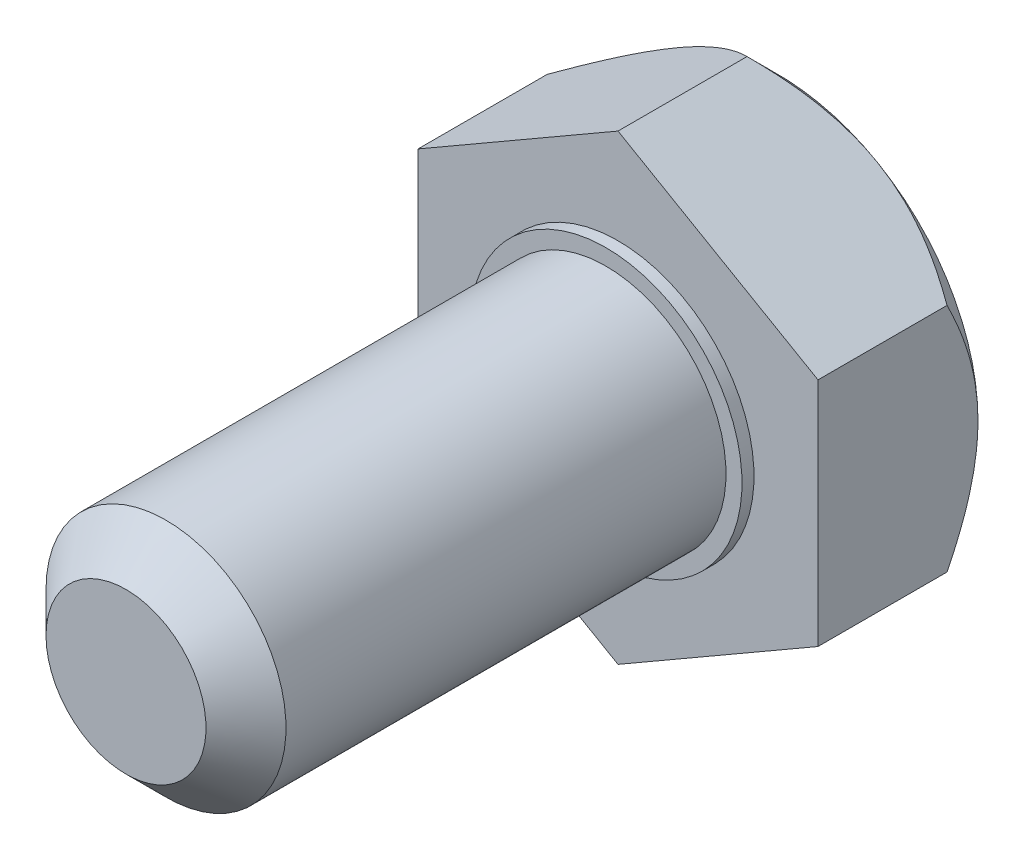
ISO-10303-21;
HEADER;
FILE_DESCRIPTION(('STEP AP214'),'2;1');
FILE_NAME('part.step','',(''),(''),'','','');
FILE_SCHEMA(('AUTOMOTIVE_DESIGN { 1 0 10303 214 1 1 1 1 }'));
ENDSEC;
DATA;
#1=APPLICATION_CONTEXT('core data for automotive mechanical design processes');
#2=APPLICATION_PROTOCOL_DEFINITION('international standard','automotive_design',2000,#1);
#3=PRODUCT_CONTEXT('',#1,'mechanical');
#4=PRODUCT('Part','Part','',(#3));
#5=PRODUCT_RELATED_PRODUCT_CATEGORY('part','',(#4));
#6=PRODUCT_DEFINITION_FORMATION('','',#4);
#7=PRODUCT_DEFINITION_CONTEXT('part definition',#1,'design');
#8=PRODUCT_DEFINITION('design','',#6,#7);
#9=PRODUCT_DEFINITION_SHAPE('','',#8);
#10=(LENGTH_UNIT() NAMED_UNIT(*) SI_UNIT(.MILLI.,.METRE.));
#11=(NAMED_UNIT(*) PLANE_ANGLE_UNIT() SI_UNIT($,.RADIAN.));
#12=(NAMED_UNIT(*) SI_UNIT($,.STERADIAN.) SOLID_ANGLE_UNIT());
#13=UNCERTAINTY_MEASURE_WITH_UNIT(LENGTH_MEASURE(1.E-05),#10,'distance_accuracy_value','');
#14=(GEOMETRIC_REPRESENTATION_CONTEXT(3) GLOBAL_UNCERTAINTY_ASSIGNED_CONTEXT((#13)) GLOBAL_UNIT_ASSIGNED_CONTEXT((#10,
#11,#12)) REPRESENTATION_CONTEXT('',''));
#15=CARTESIAN_POINT('',(0.,0.,0.));
#16=DIRECTION('',(0.,0.,1.));
#17=DIRECTION('',(1.,0.,0.));
#18=AXIS2_PLACEMENT_3D('',#15,#16,#17);
#19=CARTESIAN_POINT('',(0.,0.,2.3));
#20=DIRECTION('',(0.,0.,0.999999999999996));
#21=DIRECTION('',(0.999999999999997,0.,0.));
#22=AXIS2_PLACEMENT_3D('',#19,#20,#21);
#23=PLANE('',#22);
#24=CARTESIAN_POINT('',(0.,0.,2.3));
#25=DIRECTION('',(0.,0.,0.999999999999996));
#26=DIRECTION('',(0.999999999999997,0.,0.));
#27=AXIS2_PLACEMENT_3D('',#24,#25,#26);
#28=CIRCLE('',#27,3.4);
#29=CARTESIAN_POINT('',(-3.39999999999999,0.,2.3));
#30=VERTEX_POINT('',#29);
#31=EDGE_CURVE('E288',#30,#30,#28,.T.);
#32=ORIENTED_EDGE('',*,*,#31,.T.);
#33=EDGE_LOOP('',(#32));
#34=FACE_BOUND('',#33,.T.);
#35=CARTESIAN_POINT('',(0.,0.,2.3));
#36=DIRECTION('',(0.,0.,0.999999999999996));
#37=DIRECTION('',(0.999999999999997,0.,0.));
#38=AXIS2_PLACEMENT_3D('',#35,#36,#37);
#39=CIRCLE('',#38,3.);
#40=CARTESIAN_POINT('',(-2.99999999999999,0.,2.3));
#41=VERTEX_POINT('',#40);
#42=EDGE_CURVE('E294',#41,#41,#39,.T.);
#43=ORIENTED_EDGE('',*,*,#42,.F.);
#44=EDGE_LOOP('',(#43));
#45=FACE_BOUND('',#44,.T.);
#46=ADVANCED_FACE('F46',(#34,#45),#23,.T.);
#47=CARTESIAN_POINT('',(0.,5.77350269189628,2.));
#48=DIRECTION('',(0.,0.,0.999999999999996));
#49=DIRECTION('',(0.999999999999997,0.,0.));
#50=AXIS2_PLACEMENT_3D('',#47,#48,#49);
#51=PLANE('',#50);
#52=DIRECTION('',(0.866025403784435,0.500000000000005,0.));
#53=VECTOR('',#52,1.);
#54=CARTESIAN_POINT('',(-5.,2.88675134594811,2.));
#55=LINE('',#54,#53);
#56=CARTESIAN_POINT('',(-5.,2.88675134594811,2.));
#57=VERTEX_POINT('',#56);
#58=CARTESIAN_POINT('',(0.,5.77350269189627,2.));
#59=VERTEX_POINT('',#58);
#60=EDGE_CURVE('E268',#57,#59,#55,.T.);
#61=ORIENTED_EDGE('',*,*,#60,.F.);
#62=DIRECTION('',(0.,-1.,0.));
#63=VECTOR('',#62,1.);
#64=CARTESIAN_POINT('',(-5.,2.88675134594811,2.));
#65=LINE('',#64,#63);
#66=CARTESIAN_POINT('',(-5.,-2.88675134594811,2.));
#67=VERTEX_POINT('',#66);
#68=EDGE_CURVE('E248',#57,#67,#65,.T.);
#69=ORIENTED_EDGE('',*,*,#68,.T.);
#70=DIRECTION('',(0.866025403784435,-0.500000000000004,0.));
#71=VECTOR('',#70,1.);
#72=CARTESIAN_POINT('',(-5.,-2.88675134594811,2.));
#73=LINE('',#72,#71);
#74=CARTESIAN_POINT('',(0.,-5.77350269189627,2.00000000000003));
#75=VERTEX_POINT('',#74);
#76=EDGE_CURVE('E260',#67,#75,#73,.T.);
#77=ORIENTED_EDGE('',*,*,#76,.T.);
#78=DIRECTION('',(-0.866025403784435,-0.500000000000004,0.));
#79=VECTOR('',#78,1.);
#80=CARTESIAN_POINT('',(5.,-2.8867513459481,2.00000000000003));
#81=LINE('',#80,#79);
#82=CARTESIAN_POINT('',(5.,-2.8867513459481,2.00000000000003));
#83=VERTEX_POINT('',#82);
#84=EDGE_CURVE('E262',#83,#75,#81,.T.);
#85=ORIENTED_EDGE('',*,*,#84,.F.);
#86=DIRECTION('',(0.,-1.,0.));
#87=VECTOR('',#86,1.);
#88=CARTESIAN_POINT('',(4.99999999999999,2.88675134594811,2.));
#89=LINE('',#88,#87);
#90=CARTESIAN_POINT('',(4.99999999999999,2.88675134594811,2.));
#91=VERTEX_POINT('',#90);
#92=EDGE_CURVE('E265',#91,#83,#89,.T.);
#93=ORIENTED_EDGE('',*,*,#92,.F.);
#94=DIRECTION('',(-0.866025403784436,0.500000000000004,0.));
#95=VECTOR('',#94,1.);
#96=CARTESIAN_POINT('',(4.99999999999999,2.88675134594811,2.));
#97=LINE('',#96,#95);
#98=EDGE_CURVE('E267',#91,#59,#97,.T.);
#99=ORIENTED_EDGE('',*,*,#98,.T.);
#100=EDGE_LOOP('',(#61,#69,#77,#85,#93,#99));
#101=FACE_BOUND('',#100,.T.);
#102=CARTESIAN_POINT('',(0.,0.,2.));
#103=DIRECTION('',(0.,0.,0.999999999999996));
#104=DIRECTION('',(0.999999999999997,0.,0.));
#105=AXIS2_PLACEMENT_3D('',#102,#103,#104);
#106=CIRCLE('',#105,3.4);
#107=CARTESIAN_POINT('',(-3.39999999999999,0.,2.));
#108=VERTEX_POINT('',#107);
#109=EDGE_CURVE('E290',#108,#108,#106,.T.);
#110=ORIENTED_EDGE('',*,*,#109,.F.);
#111=EDGE_LOOP('',(#110));
#112=FACE_BOUND('',#111,.T.);
#113=ADVANCED_FACE('F179',(#101,#112),#51,.T.);
#114=CARTESIAN_POINT('',(-5.,2.88675134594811,2.));
#115=DIRECTION('',(-0.500000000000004,0.866025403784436,0.));
#116=DIRECTION('',(-0.866025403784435,-0.500000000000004,0.));
#117=AXIS2_PLACEMENT_3D('',#114,#115,#116);
#118=PLANE('',#117);
#119=DIRECTION('',(0.,0.,-0.999999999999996));
#120=VECTOR('',#119,1.);
#121=CARTESIAN_POINT('',(0.,5.77350269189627,2.));
#122=LINE('',#121,#120);
#123=CARTESIAN_POINT('',(0.,5.77350269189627,-1.22649730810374));
#124=VERTEX_POINT('',#123);
#125=EDGE_CURVE('E244',#59,#124,#122,.T.);
#126=ORIENTED_EDGE('',*,*,#125,.T.);
#127=CARTESIAN_POINT('',(0.000200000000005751,5.7736181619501,-1.22638183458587));
#128=CARTESIAN_POINT('',(-0.0857727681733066,5.72398176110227,-1.27601376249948));
#129=CARTESIAN_POINT('',(-0.172406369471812,5.67396382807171,-1.32412258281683));
#130=CARTESIAN_POINT('',(-0.347124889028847,5.57309004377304,-1.41683067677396));
#131=CARTESIAN_POINT('',(-0.43521056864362,5.5222337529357,-1.46142803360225));
#132=CARTESIAN_POINT('',(-0.702658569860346,5.367822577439,-1.58963823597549));
#133=CARTESIAN_POINT('',(-0.884284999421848,5.26296050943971,-1.66712224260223));
#134=CARTESIAN_POINT('',(-1.25054924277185,5.05149774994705,-1.79980836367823));
#135=CARTESIAN_POINT('',(-1.43509343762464,4.94495110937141,-1.85534476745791));
#136=CARTESIAN_POINT('',(-1.71494377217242,4.78337944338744,-1.91958681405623));
#137=CARTESIAN_POINT('',(-1.80863923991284,4.72928433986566,-1.93781514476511));
#138=CARTESIAN_POINT('',(-1.99682352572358,4.62063609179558,-1.96750512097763));
#139=CARTESIAN_POINT('',(-2.09131222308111,4.56608301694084,-1.97896777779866));
#140=CARTESIAN_POINT('',(-2.32156625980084,4.43314578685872,-1.99818644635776));
#141=CARTESIAN_POINT('',(-2.45757968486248,4.35461839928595,-2.00221901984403));
#142=CARTESIAN_POINT('',(-2.72936141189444,4.19770514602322,-1.99545145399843));
#143=CARTESIAN_POINT('',(-2.86512961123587,4.11931933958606,-1.98464611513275));
#144=CARTESIAN_POINT('',(-3.1353860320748,3.96328672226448,-1.9488396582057));
#145=CARTESIAN_POINT('',(-3.26987265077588,3.885640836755,-1.92382266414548));
#146=CARTESIAN_POINT('',(-3.5365343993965,3.73168360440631,-1.8609529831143));
#147=CARTESIAN_POINT('',(-3.66870970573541,3.65537215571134,-1.82310128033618));
#148=CARTESIAN_POINT('',(-3.90334820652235,3.51990355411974,-1.7452274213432));
#149=CARTESIAN_POINT('',(-4.00633089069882,3.46044647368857,-1.70725305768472));
#150=CARTESIAN_POINT('',(-4.21044753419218,3.34259967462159,-1.6251846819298));
#151=CARTESIAN_POINT('',(-4.31158143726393,3.28420998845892,-1.58109048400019));
#152=CARTESIAN_POINT('',(-4.51168198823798,3.16868188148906,-1.48777092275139));
#153=CARTESIAN_POINT('',(-4.61065432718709,3.11154017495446,-1.43856169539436));
#154=CARTESIAN_POINT('',(-4.80676624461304,2.9983149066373,-1.33565818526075));
#155=CARTESIAN_POINT('',(-4.90390690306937,2.94223072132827,-1.28196665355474));
#156=CARTESIAN_POINT('',(-5.00019999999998,2.88663587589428,-1.22638183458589));
#157=B_SPLINE_CURVE_WITH_KNOTS('',3,(#127,#128,#129,#130,#131,#132,#133,#134,#135,#136,#137,
#138,#139,#140,#141,#142,#143,#144,#145,#146,#147,#148,#149,#150,#151,#152,#153,#154,#155,#156),
.UNSPECIFIED.,.F.,.F.,(4,2,2,2,2,2,2,2,2,2,2,2,2,2,4),(0.,0.332945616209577,0.666071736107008,
1.33592065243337,1.99513262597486,2.3240920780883,2.65300234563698,3.1235896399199,
3.59434188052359,4.06562104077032,4.53686407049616,4.9111795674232,5.28550643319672,
5.65868635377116,6.03163889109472),.UNSPECIFIED.);
#158=CARTESIAN_POINT('',(-2.50000000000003,4.33012701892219,-2.));
#159=VERTEX_POINT('',#158);
#160=EDGE_CURVE('E193',#124,#159,#157,.T.);
#161=ORIENTED_EDGE('',*,*,#160,.T.);
#162=CARTESIAN_POINT('',(-5.,2.88675134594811,-1.22649730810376));
#163=VERTEX_POINT('',#162);
#164=EDGE_CURVE('E61',#159,#163,#157,.T.);
#165=ORIENTED_EDGE('',*,*,#164,.T.);
#166=DIRECTION('',(0.,0.,-0.999999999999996));
#167=VECTOR('',#166,1.);
#168=CARTESIAN_POINT('',(-5.,2.88675134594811,2.));
#169=LINE('',#168,#167);
#170=EDGE_CURVE('E143',#57,#163,#169,.T.);
#171=ORIENTED_EDGE('',*,*,#170,.F.);
#172=ORIENTED_EDGE('',*,*,#60,.T.);
#173=EDGE_LOOP('',(#126,#161,#165,#171,#172));
#174=FACE_BOUND('',#173,.T.);
#175=ADVANCED_FACE('F204',(#174),#118,.T.);
#176=CARTESIAN_POINT('',(-5.,2.88675134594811,2.));
#177=DIRECTION('',(0.999999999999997,0.,0.));
#178=DIRECTION('',(0.,1.,0.));
#179=AXIS2_PLACEMENT_3D('',#176,#177,#178);
#180=PLANE('',#179);
#181=CARTESIAN_POINT('',(-5.00000000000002,-6.53135818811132,1.22548720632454));
#182=CARTESIAN_POINT('',(-5.00000000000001,-6.37531947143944,1.10161336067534));
#183=CARTESIAN_POINT('',(-5.,-6.21850022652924,0.978708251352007));
#184=CARTESIAN_POINT('',(-5.,-5.90296218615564,0.735293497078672));
#185=CARTESIAN_POINT('',(-5.,-5.74424299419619,0.614784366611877));
#186=CARTESIAN_POINT('',(-5.,-5.42341951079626,0.375768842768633));
#187=CARTESIAN_POINT('',(-5.,-5.26129866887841,0.25728459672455));
#188=CARTESIAN_POINT('',(-5.,-4.93447093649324,0.0239519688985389));
#189=CARTESIAN_POINT('',(-5.,-4.76976421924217,-0.0908966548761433));
#190=CARTESIAN_POINT('',(-5.,-4.424717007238,-0.324612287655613));
#191=CARTESIAN_POINT('',(-5.,-4.24413623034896,-0.443126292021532));
#192=CARTESIAN_POINT('',(-5.,-3.87871872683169,-0.673521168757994));
#193=CARTESIAN_POINT('',(-5.,-3.69388121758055,-0.785400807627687));
#194=CARTESIAN_POINT('',(-5.,-3.31977799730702,-1.00020541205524));
#195=CARTESIAN_POINT('',(-5.,-3.13052734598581,-1.10315640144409));
#196=CARTESIAN_POINT('',(-5.,-2.7463660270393,-1.2977972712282));
#197=CARTESIAN_POINT('',(-5.,-2.55145827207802,-1.38949282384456));
#198=CARTESIAN_POINT('',(-5.,-2.18059279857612,-1.54742549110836));
#199=CARTESIAN_POINT('',(-5.,-2.00539022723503,-1.61541811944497));
#200=CARTESIAN_POINT('',(-5.,-1.65008398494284,-1.73739954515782));
#201=CARTESIAN_POINT('',(-5.,-1.4699800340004,-1.79138754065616));
#202=CARTESIAN_POINT('',(-5.,-1.10937063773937,-1.88131689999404));
#203=CARTESIAN_POINT('',(-5.,-0.928957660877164,-1.91762243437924));
#204=CARTESIAN_POINT('',(-5.,-0.565325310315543,-1.97134984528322));
#205=CARTESIAN_POINT('',(-5.,-0.382106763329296,-1.98877718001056));
#206=CARTESIAN_POINT('',(-5.,-0.0259087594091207,-2.00290845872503));
#207=CARTESIAN_POINT('',(-5.,0.147023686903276,-2.00079586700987));
#208=CARTESIAN_POINT('',(-5.,0.491748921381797,-1.9788233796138));
#209=CARTESIAN_POINT('',(-5.,0.663541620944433,-1.95896212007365));
#210=CARTESIAN_POINT('',(-5.,1.00768444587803,-1.90235035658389));
#211=CARTESIAN_POINT('',(-5.,1.17998104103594,-1.86528049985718));
#212=CARTESIAN_POINT('',(-5.,1.52067843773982,-1.77645895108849));
#213=CARTESIAN_POINT('',(-5.,1.68907924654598,-1.7247072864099));
#214=CARTESIAN_POINT('',(-5.,2.02252656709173,-1.60870859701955));
#215=CARTESIAN_POINT('',(-5.,2.18754882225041,-1.54439278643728));
#216=CARTESIAN_POINT('',(-5.,2.51338244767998,-1.40577668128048));
#217=CARTESIAN_POINT('',(-5.,2.6741919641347,-1.33147207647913));
#218=CARTESIAN_POINT('',(-5.,2.99233161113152,-1.17463871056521));
#219=CARTESIAN_POINT('',(-5.,3.14964950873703,-1.0920853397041));
#220=CARTESIAN_POINT('',(-5.,3.46069390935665,-0.920561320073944));
#221=CARTESIAN_POINT('',(-5.,3.61442093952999,-0.831591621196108));
#222=CARTESIAN_POINT('',(-5.,3.91123580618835,-0.652998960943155));
#223=CARTESIAN_POINT('',(-5.,4.05447425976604,-0.56362499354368));
#224=CARTESIAN_POINT('',(-5.,4.33848976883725,-0.381037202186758));
#225=CARTESIAN_POINT('',(-5.,4.47926664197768,-0.28782309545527));
#226=CARTESIAN_POINT('',(-5.,4.75756267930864,-0.0989842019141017));
#227=CARTESIAN_POINT('',(-5.00000000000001,4.89509880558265,-0.00338432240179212));
#228=CARTESIAN_POINT('',(-5.00000000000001,5.16827918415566,0.190405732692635));
#229=CARTESIAN_POINT('',(-5.00000000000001,5.30392394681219,0.288595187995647));
#230=CARTESIAN_POINT('',(-5.,5.43877409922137,0.387845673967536));
#231=B_SPLINE_CURVE_WITH_KNOTS('',3,(#181,#182,#183,#184,#185,#186,#187,#188,#189,#190,#191,
#192,#193,#194,#195,#196,#197,#198,#199,#200,#201,#202,#203,#204,#205,#206,#207,#208,#209,#210,
#211,#212,#213,#214,#215,#216,#217,#218,#219,#220,#221,#222,#223,#224,#225,#226,#227,#228,#229,
#230),.UNSPECIFIED.,.F.,.F.,(4,2,2,2,2,2,2,2,2,2,2,2,2,2,2,2,2,2,2,2,2,2,2,2,4),(0.,
0.597701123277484,1.19552923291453,1.79789552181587,2.40022163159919,3.04810134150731,
3.69610113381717,4.34214388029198,4.9878597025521,5.55118783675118,6.11454821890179,
6.66575607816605,7.21680452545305,7.73470726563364,8.25264980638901,8.78061396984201,
9.30857714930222,9.83951619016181,10.3706850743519,10.9034888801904,11.4362139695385,
11.9426447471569,12.4491128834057,12.9515739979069,13.4538967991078),.UNSPECIFIED.);
#232=CARTESIAN_POINT('',(-5.,-2.88675134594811,-1.22649730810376));
#233=VERTEX_POINT('',#232);
#234=CARTESIAN_POINT('',(-4.99999999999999,0.,-2.));
#235=VERTEX_POINT('',#234);
#236=EDGE_CURVE('E69',#233,#235,#231,.T.);
#237=ORIENTED_EDGE('',*,*,#236,.F.);
#238=DIRECTION('',(0.,0.,-0.999999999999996));
#239=VECTOR('',#238,1.);
#240=CARTESIAN_POINT('',(-5.,-2.88675134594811,2.));
#241=LINE('',#240,#239);
#242=EDGE_CURVE('E254',#67,#233,#241,.T.);
#243=ORIENTED_EDGE('',*,*,#242,.F.);
#244=ORIENTED_EDGE('',*,*,#68,.F.);
#245=ORIENTED_EDGE('',*,*,#170,.T.);
#246=EDGE_CURVE('E270',#235,#163,#231,.T.);
#247=ORIENTED_EDGE('',*,*,#246,.F.);
#248=EDGE_LOOP('',(#237,#243,#244,#245,#247));
#249=FACE_BOUND('',#248,.T.);
#250=ADVANCED_FACE('F207',(#249),#180,.F.);
#251=CARTESIAN_POINT('',(-5.,-2.88675134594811,2.));
#252=DIRECTION('',(0.500000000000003,0.866025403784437,0.));
#253=DIRECTION('',(-0.866025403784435,0.500000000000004,0.));
#254=AXIS2_PLACEMENT_3D('',#251,#252,#253);
#255=PLANE('',#254);
#256=CARTESIAN_POINT('',(0.000200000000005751,-5.77361816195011,-1.22638183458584));
#257=CARTESIAN_POINT('',(-0.0857727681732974,-5.72398176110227,-1.27601376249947));
#258=CARTESIAN_POINT('',(-0.172406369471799,-5.67396382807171,-1.32412258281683));
#259=CARTESIAN_POINT('',(-0.347124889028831,-5.57309004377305,-1.41683067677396));
#260=CARTESIAN_POINT('',(-0.435210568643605,-5.52223375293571,-1.46142803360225));
#261=CARTESIAN_POINT('',(-0.70265856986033,-5.367822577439,-1.58963823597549));
#262=CARTESIAN_POINT('',(-0.88428499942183,-5.26296050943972,-1.66712224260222));
#263=CARTESIAN_POINT('',(-1.25054924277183,-5.05149774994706,-1.79980836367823));
#264=CARTESIAN_POINT('',(-1.43509343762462,-4.94495110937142,-1.85534476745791));
#265=CARTESIAN_POINT('',(-1.7149437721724,-4.78337944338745,-1.91958681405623));
#266=CARTESIAN_POINT('',(-1.80863923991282,-4.72928433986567,-1.93781514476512));
#267=CARTESIAN_POINT('',(-1.99682352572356,-4.62063609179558,-1.96750512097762));
#268=CARTESIAN_POINT('',(-2.09131222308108,-4.56608301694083,-1.97896777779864));
#269=CARTESIAN_POINT('',(-2.32156625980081,-4.43314578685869,-1.99818644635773));
#270=CARTESIAN_POINT('',(-2.45757968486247,-4.35461839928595,-2.00221901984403));
#271=CARTESIAN_POINT('',(-2.72936141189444,-4.19770514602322,-1.99545145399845));
#272=CARTESIAN_POINT('',(-2.86512961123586,-4.11931933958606,-1.98464611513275));
#273=CARTESIAN_POINT('',(-3.1353860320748,-3.96328672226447,-1.9488396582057));
#274=CARTESIAN_POINT('',(-3.26987265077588,-3.885640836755,-1.92382266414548));
#275=CARTESIAN_POINT('',(-3.5365343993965,-3.7316836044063,-1.86095298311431));
#276=CARTESIAN_POINT('',(-3.66870970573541,-3.65537215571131,-1.82310128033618));
#277=CARTESIAN_POINT('',(-3.90334820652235,-3.51990355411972,-1.7452274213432));
#278=CARTESIAN_POINT('',(-4.00633089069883,-3.46044647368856,-1.70725305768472));
#279=CARTESIAN_POINT('',(-4.21044753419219,-3.34259967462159,-1.62518468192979));
#280=CARTESIAN_POINT('',(-4.31158143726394,-3.28420998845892,-1.58109048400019));
#281=CARTESIAN_POINT('',(-4.51168198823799,-3.16868188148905,-1.48777092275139));
#282=CARTESIAN_POINT('',(-4.6106543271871,-3.11154017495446,-1.43856169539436));
#283=CARTESIAN_POINT('',(-4.80676624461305,-2.99831490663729,-1.33565818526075));
#284=CARTESIAN_POINT('',(-4.90390690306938,-2.94223072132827,-1.28196665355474));
#285=CARTESIAN_POINT('',(-5.0002,-2.88663587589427,-1.22638183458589));
#286=B_SPLINE_CURVE_WITH_KNOTS('',3,(#256,#257,#258,#259,#260,#261,#262,#263,#264,#265,#266,
#267,#268,#269,#270,#271,#272,#273,#274,#275,#276,#277,#278,#279,#280,#281,#282,#283,#284,#285),
.UNSPECIFIED.,.F.,.F.,(4,2,2,2,2,2,2,2,2,2,2,2,2,2,4),(0.,0.332945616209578,0.66607173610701,
1.33592065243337,1.99513262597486,2.3240920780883,2.65300234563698,3.12358963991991,
3.59434188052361,4.06562104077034,4.53686407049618,4.91117956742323,5.28550643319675,
5.65868635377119,6.03163889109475),.UNSPECIFIED.);
#287=CARTESIAN_POINT('',(0.,-5.77350269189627,-1.22649730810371));
#288=VERTEX_POINT('',#287);
#289=CARTESIAN_POINT('',(-2.50000000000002,-4.33012701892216,-2.));
#290=VERTEX_POINT('',#289);
#291=EDGE_CURVE('E187',#288,#290,#286,.T.);
#292=ORIENTED_EDGE('',*,*,#291,.F.);
#293=DIRECTION('',(0.,0.,-0.999999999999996));
#294=VECTOR('',#293,1.);
#295=CARTESIAN_POINT('',(0.,-5.77350269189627,2.00000000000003));
#296=LINE('',#295,#294);
#297=EDGE_CURVE('E251',#75,#288,#296,.T.);
#298=ORIENTED_EDGE('',*,*,#297,.F.);
#299=ORIENTED_EDGE('',*,*,#76,.F.);
#300=ORIENTED_EDGE('',*,*,#242,.T.);
#301=EDGE_CURVE('E198',#290,#233,#286,.T.);
#302=ORIENTED_EDGE('',*,*,#301,.F.);
#303=EDGE_LOOP('',(#292,#298,#299,#300,#302));
#304=FACE_BOUND('',#303,.T.);
#305=ADVANCED_FACE('F279',(#304),#255,.F.);
#306=CARTESIAN_POINT('',(5.,-2.8867513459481,2.00000000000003));
#307=DIRECTION('',(0.500000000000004,-0.866025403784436,0.));
#308=DIRECTION('',(0.866025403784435,0.500000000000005,0.));
#309=AXIS2_PLACEMENT_3D('',#306,#307,#308);
#310=PLANE('',#309);
#311=ORIENTED_EDGE('',*,*,#297,.T.);
#312=CARTESIAN_POINT('',(-0.000199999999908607,-5.7736181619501,-1.22638183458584));
#313=CARTESIAN_POINT('',(0.0857727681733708,-5.72398176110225,-1.27601376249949));
#314=CARTESIAN_POINT('',(0.172406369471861,-5.67396382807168,-1.32412258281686));
#315=CARTESIAN_POINT('',(0.347124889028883,-5.57309004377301,-1.41683067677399));
#316=CARTESIAN_POINT('',(0.435210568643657,-5.52223375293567,-1.46142803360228));
#317=CARTESIAN_POINT('',(0.70265856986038,-5.36782257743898,-1.5896382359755));
#318=CARTESIAN_POINT('',(0.884284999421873,-5.2629605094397,-1.66712224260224));
#319=CARTESIAN_POINT('',(1.25054924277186,-5.05149774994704,-1.79980836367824));
#320=CARTESIAN_POINT('',(1.43509343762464,-4.9449511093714,-1.85534476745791));
#321=CARTESIAN_POINT('',(1.71494377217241,-4.78337944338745,-1.91958681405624));
#322=CARTESIAN_POINT('',(1.80863923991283,-4.72928433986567,-1.93781514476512));
#323=CARTESIAN_POINT('',(1.99682352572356,-4.62063609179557,-1.96750512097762));
#324=CARTESIAN_POINT('',(2.09131222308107,-4.56608301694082,-1.97896777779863));
#325=CARTESIAN_POINT('',(2.3215662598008,-4.43314578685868,-1.99818644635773));
#326=CARTESIAN_POINT('',(2.45757968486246,-4.35461839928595,-2.00221901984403));
#327=CARTESIAN_POINT('',(2.72936141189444,-4.19770514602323,-1.99545145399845));
#328=CARTESIAN_POINT('',(2.86512961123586,-4.11931933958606,-1.98464611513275));
#329=CARTESIAN_POINT('',(3.1353860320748,-3.96328672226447,-1.94883965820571));
#330=CARTESIAN_POINT('',(3.26987265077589,-3.885640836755,-1.92382266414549));
#331=CARTESIAN_POINT('',(3.5365343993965,-3.7316836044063,-1.8609529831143));
#332=CARTESIAN_POINT('',(3.66870970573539,-3.65537215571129,-1.82310128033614));
#333=CARTESIAN_POINT('',(3.90334820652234,-3.5199035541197,-1.74522742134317));
#334=CARTESIAN_POINT('',(4.00633089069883,-3.46044647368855,-1.70725305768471));
#335=CARTESIAN_POINT('',(4.21044753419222,-3.34259967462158,-1.6251846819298));
#336=CARTESIAN_POINT('',(4.31158143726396,-3.2842099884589,-1.58109048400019));
#337=CARTESIAN_POINT('',(4.51168198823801,-3.16868188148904,-1.48777092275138));
#338=CARTESIAN_POINT('',(4.61065432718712,-3.11154017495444,-1.43856169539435));
#339=CARTESIAN_POINT('',(4.80676624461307,-2.99831490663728,-1.33565818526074));
#340=CARTESIAN_POINT('',(4.90390690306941,-2.94223072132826,-1.28196665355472));
#341=CARTESIAN_POINT('',(5.00020000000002,-2.88663587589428,-1.22638183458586));
#342=B_SPLINE_CURVE_WITH_KNOTS('',3,(#312,#313,#314,#315,#316,#317,#318,#319,#320,#321,#322,
#323,#324,#325,#326,#327,#328,#329,#330,#331,#332,#333,#334,#335,#336,#337,#338,#339,#340,#341),
.UNSPECIFIED.,.F.,.F.,(4,2,2,2,2,2,2,2,2,2,2,2,2,2,4),(0.,0.332945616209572,0.666071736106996,
1.33592065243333,1.9951326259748,2.32409207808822,2.65300234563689,3.12358963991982,
3.59434188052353,4.06562104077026,4.53686407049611,4.91117956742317,5.28550643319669,
5.65868635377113,6.0316388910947),.UNSPECIFIED.);
#343=CARTESIAN_POINT('',(2.50000000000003,-4.33012701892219,-1.99999999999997));
#344=VERTEX_POINT('',#343);
#345=EDGE_CURVE('E152',#288,#344,#342,.T.);
#346=ORIENTED_EDGE('',*,*,#345,.T.);
#347=CARTESIAN_POINT('',(5.,-2.8867513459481,-1.22649730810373));
#348=VERTEX_POINT('',#347);
#349=EDGE_CURVE('E138',#344,#348,#342,.T.);
#350=ORIENTED_EDGE('',*,*,#349,.T.);
#351=DIRECTION('',(0.,0.,-0.999999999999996));
#352=VECTOR('',#351,1.);
#353=CARTESIAN_POINT('',(5.,-2.8867513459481,2.00000000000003));
#354=LINE('',#353,#352);
#355=EDGE_CURVE('E151',#83,#348,#354,.T.);
#356=ORIENTED_EDGE('',*,*,#355,.F.);
#357=ORIENTED_EDGE('',*,*,#84,.T.);
#358=EDGE_LOOP('',(#311,#346,#350,#356,#357));
#359=FACE_BOUND('',#358,.T.);
#360=ADVANCED_FACE('F218',(#359),#310,.T.);
#361=CARTESIAN_POINT('',(4.99999999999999,2.88675134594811,2.));
#362=DIRECTION('',(0.999999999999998,0.,0.));
#363=DIRECTION('',(0.,1.,0.));
#364=AXIS2_PLACEMENT_3D('',#361,#362,#363);
#365=PLANE('',#364);
#366=ORIENTED_EDGE('',*,*,#355,.T.);
#367=CARTESIAN_POINT('',(4.99999999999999,-6.53135818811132,1.22548720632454));
#368=CARTESIAN_POINT('',(4.99999999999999,-6.37531947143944,1.10161336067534));
#369=CARTESIAN_POINT('',(4.99999999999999,-6.21850022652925,0.978708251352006));
#370=CARTESIAN_POINT('',(4.99999999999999,-5.90296218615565,0.735293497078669));
#371=CARTESIAN_POINT('',(4.99999999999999,-5.7442429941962,0.614784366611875));
#372=CARTESIAN_POINT('',(4.99999999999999,-5.42341951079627,0.375768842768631));
#373=CARTESIAN_POINT('',(4.99999999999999,-5.26129866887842,0.257284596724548));
#374=CARTESIAN_POINT('',(4.99999999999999,-4.93447093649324,0.0239519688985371));
#375=CARTESIAN_POINT('',(4.99999999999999,-4.76976421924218,-0.090896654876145));
#376=CARTESIAN_POINT('',(4.99999999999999,-4.42471700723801,-0.324612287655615));
#377=CARTESIAN_POINT('',(4.99999999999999,-4.24413623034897,-0.443126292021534));
#378=CARTESIAN_POINT('',(4.99999999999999,-3.8787187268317,-0.673521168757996));
#379=CARTESIAN_POINT('',(4.99999999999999,-3.69388121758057,-0.785400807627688));
#380=CARTESIAN_POINT('',(4.99999999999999,-3.31977799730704,-1.00020541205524));
#381=CARTESIAN_POINT('',(4.99999999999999,-3.13052734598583,-1.10315640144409));
#382=CARTESIAN_POINT('',(4.99999999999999,-2.74636602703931,-1.2977972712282));
#383=CARTESIAN_POINT('',(5.00000000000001,-2.55145827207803,-1.38949282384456));
#384=CARTESIAN_POINT('',(5.,-2.18059279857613,-1.54742549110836));
#385=CARTESIAN_POINT('',(4.99999999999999,-2.00539022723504,-1.61541811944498));
#386=CARTESIAN_POINT('',(4.99999999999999,-1.65008398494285,-1.73739954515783));
#387=CARTESIAN_POINT('',(4.99999999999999,-1.46998003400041,-1.79138754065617));
#388=CARTESIAN_POINT('',(4.99999999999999,-1.10937063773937,-1.88131689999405));
#389=CARTESIAN_POINT('',(4.99999999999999,-0.928957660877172,-1.91762243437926));
#390=CARTESIAN_POINT('',(4.99999999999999,-0.565325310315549,-1.97134984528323));
#391=CARTESIAN_POINT('',(4.99999999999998,-0.3821067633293,-1.98877718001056));
#392=CARTESIAN_POINT('',(4.99999999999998,-0.0259087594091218,-2.00290845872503));
#393=CARTESIAN_POINT('',(4.99999999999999,0.147023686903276,-2.00079586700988));
#394=CARTESIAN_POINT('',(4.99999999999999,0.491748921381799,-1.97882337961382));
#395=CARTESIAN_POINT('',(4.99999999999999,0.663541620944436,-1.95896212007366));
#396=CARTESIAN_POINT('',(4.99999999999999,1.00768444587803,-1.9023503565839));
#397=CARTESIAN_POINT('',(4.99999999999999,1.17998104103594,-1.86528049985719));
#398=CARTESIAN_POINT('',(4.99999999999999,1.52067843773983,-1.7764589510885));
#399=CARTESIAN_POINT('',(5.,1.68907924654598,-1.7247072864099));
#400=CARTESIAN_POINT('',(5.,2.02252656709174,-1.60870859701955));
#401=CARTESIAN_POINT('',(4.99999999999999,2.18754882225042,-1.54439278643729));
#402=CARTESIAN_POINT('',(4.99999999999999,2.51338244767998,-1.40577668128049));
#403=CARTESIAN_POINT('',(4.99999999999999,2.67419196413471,-1.33147207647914));
#404=CARTESIAN_POINT('',(4.99999999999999,2.99233161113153,-1.17463871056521));
#405=CARTESIAN_POINT('',(4.99999999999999,3.14964950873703,-1.09208533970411));
#406=CARTESIAN_POINT('',(4.99999999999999,3.46069390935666,-0.920561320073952));
#407=CARTESIAN_POINT('',(4.99999999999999,3.61442093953,-0.831591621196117));
#408=CARTESIAN_POINT('',(4.99999999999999,3.91123580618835,-0.652998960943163));
#409=CARTESIAN_POINT('',(4.99999999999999,4.05447425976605,-0.563624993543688));
#410=CARTESIAN_POINT('',(4.99999999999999,4.33848976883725,-0.381037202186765));
#411=CARTESIAN_POINT('',(4.99999999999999,4.47926664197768,-0.287823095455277));
#412=CARTESIAN_POINT('',(4.99999999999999,4.75756267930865,-0.0989842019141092));
#413=CARTESIAN_POINT('',(5.,4.89509880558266,-0.00338432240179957));
#414=CARTESIAN_POINT('',(4.99999999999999,5.16827918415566,0.190405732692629));
#415=CARTESIAN_POINT('',(4.99999999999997,5.3039239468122,0.288595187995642));
#416=CARTESIAN_POINT('',(4.99999999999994,5.43877409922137,0.387845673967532));
#417=B_SPLINE_CURVE_WITH_KNOTS('',3,(#367,#368,#369,#370,#371,#372,#373,#374,#375,#376,#377,
#378,#379,#380,#381,#382,#383,#384,#385,#386,#387,#388,#389,#390,#391,#392,#393,#394,#395,#396,
#397,#398,#399,#400,#401,#402,#403,#404,#405,#406,#407,#408,#409,#410,#411,#412,#413,#414,#415,
#416),.UNSPECIFIED.,.F.,.F.,(4,2,2,2,2,2,2,2,2,2,2,2,2,2,2,2,2,2,2,2,2,2,2,2,4),(0.,
0.597701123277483,1.19552923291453,1.79789552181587,2.40022163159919,3.04810134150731,
3.69610113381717,4.34214388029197,4.98785970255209,5.55118783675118,6.11454821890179,
6.66575607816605,7.21680452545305,7.73470726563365,8.25264980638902,8.78061396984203,
9.30857714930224,9.83951619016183,10.3706850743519,10.9034888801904,11.4362139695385,
11.942644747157,12.4491128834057,12.9515739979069,13.4538967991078),.UNSPECIFIED.);
#418=CARTESIAN_POINT('',(5.,0.,-2.));
#419=VERTEX_POINT('',#418);
#420=EDGE_CURVE('E129',#348,#419,#417,.T.);
#421=ORIENTED_EDGE('',*,*,#420,.T.);
#422=CARTESIAN_POINT('',(4.99999999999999,2.88675134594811,-1.22649730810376));
#423=VERTEX_POINT('',#422);
#424=EDGE_CURVE('E118',#419,#423,#417,.T.);
#425=ORIENTED_EDGE('',*,*,#424,.T.);
#426=DIRECTION('',(0.,0.,-0.999999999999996));
#427=VECTOR('',#426,1.);
#428=CARTESIAN_POINT('',(4.99999999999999,2.88675134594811,2.));
#429=LINE('',#428,#427);
#430=EDGE_CURVE('E247',#91,#423,#429,.T.);
#431=ORIENTED_EDGE('',*,*,#430,.F.);
#432=ORIENTED_EDGE('',*,*,#92,.T.);
#433=EDGE_LOOP('',(#366,#421,#425,#431,#432));
#434=FACE_BOUND('',#433,.T.);
#435=ADVANCED_FACE('F149',(#434),#365,.T.);
#436=CARTESIAN_POINT('',(4.99999999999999,2.88675134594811,2.));
#437=DIRECTION('',(-0.500000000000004,-0.866025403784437,0.));
#438=DIRECTION('',(0.866025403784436,-0.500000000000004,0.));
#439=AXIS2_PLACEMENT_3D('',#436,#437,#438);
#440=PLANE('',#439);
#441=CARTESIAN_POINT('',(-0.000199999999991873,5.77361816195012,-1.22638183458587));
#442=CARTESIAN_POINT('',(0.0857727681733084,5.72398176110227,-1.27601376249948));
#443=CARTESIAN_POINT('',(0.172406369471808,5.67396382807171,-1.32412258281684));
#444=CARTESIAN_POINT('',(0.347124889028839,5.57309004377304,-1.41683067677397));
#445=CARTESIAN_POINT('',(0.435210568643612,5.5222337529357,-1.46142803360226));
#446=CARTESIAN_POINT('',(0.702658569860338,5.36782257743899,-1.5896382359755));
#447=CARTESIAN_POINT('',(0.884284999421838,5.26296050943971,-1.66712224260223));
#448=CARTESIAN_POINT('',(1.25054924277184,5.05149774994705,-1.79980836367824));
#449=CARTESIAN_POINT('',(1.43509343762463,4.94495110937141,-1.85534476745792));
#450=CARTESIAN_POINT('',(1.7149437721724,4.78337944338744,-1.91958681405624));
#451=CARTESIAN_POINT('',(1.80863923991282,4.72928433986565,-1.93781514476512));
#452=CARTESIAN_POINT('',(1.99682352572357,4.62063609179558,-1.96750512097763));
#453=CARTESIAN_POINT('',(2.0913122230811,4.56608301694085,-1.97896777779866));
#454=CARTESIAN_POINT('',(2.32156625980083,4.43314578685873,-1.99818644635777));
#455=CARTESIAN_POINT('',(2.45757968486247,4.35461839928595,-2.00221901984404));
#456=CARTESIAN_POINT('',(2.72936141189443,4.19770514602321,-1.99545145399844));
#457=CARTESIAN_POINT('',(2.86512961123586,4.11931933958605,-1.98464611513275));
#458=CARTESIAN_POINT('',(3.13538603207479,3.96328672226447,-1.94883965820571));
#459=CARTESIAN_POINT('',(3.26987265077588,3.88564083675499,-1.92382266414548));
#460=CARTESIAN_POINT('',(3.5365343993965,3.7316836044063,-1.86095298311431));
#461=CARTESIAN_POINT('',(3.66870970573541,3.65537215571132,-1.82310128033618));
#462=CARTESIAN_POINT('',(3.90334820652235,3.51990355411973,-1.7452274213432));
#463=CARTESIAN_POINT('',(4.00633089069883,3.46044647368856,-1.70725305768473));
#464=CARTESIAN_POINT('',(4.21044753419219,3.34259967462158,-1.6251846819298));
#465=CARTESIAN_POINT('',(4.31158143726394,3.28420998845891,-1.5810904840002));
#466=CARTESIAN_POINT('',(4.51168198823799,3.16868188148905,-1.48777092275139));
#467=CARTESIAN_POINT('',(4.6106543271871,3.11154017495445,-1.43856169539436));
#468=CARTESIAN_POINT('',(4.80676624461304,2.99831490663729,-1.33565818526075));
#469=CARTESIAN_POINT('',(4.90390690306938,2.94223072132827,-1.28196665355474));
#470=CARTESIAN_POINT('',(5.0002,2.88663587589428,-1.22638183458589));
#471=B_SPLINE_CURVE_WITH_KNOTS('',3,(#441,#442,#443,#444,#445,#446,#447,#448,#449,#450,#451,
#452,#453,#454,#455,#456,#457,#458,#459,#460,#461,#462,#463,#464,#465,#466,#467,#468,#469,#470),
.UNSPECIFIED.,.F.,.F.,(4,2,2,2,2,2,2,2,2,2,2,2,2,2,4),(0.,0.332945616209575,0.666071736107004,
1.33592065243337,1.99513262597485,2.32409207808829,2.65300234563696,3.12358963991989,
3.59434188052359,4.06562104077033,4.53686407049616,4.91117956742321,5.28550643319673,
5.65868635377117,6.03163889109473),.UNSPECIFIED.);
#472=CARTESIAN_POINT('',(2.50000000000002,4.33012701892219,-2.));
#473=VERTEX_POINT('',#472);
#474=EDGE_CURVE('E130',#124,#473,#471,.T.);
#475=ORIENTED_EDGE('',*,*,#474,.F.);
#476=ORIENTED_EDGE('',*,*,#125,.F.);
#477=ORIENTED_EDGE('',*,*,#98,.F.);
#478=ORIENTED_EDGE('',*,*,#430,.T.);
#479=EDGE_CURVE('E125',#473,#423,#471,.T.);
#480=ORIENTED_EDGE('',*,*,#479,.F.);
#481=EDGE_LOOP('',(#475,#476,#477,#478,#480));
#482=FACE_BOUND('',#481,.T.);
#483=ADVANCED_FACE('F209',(#482),#440,.F.);
#484=CARTESIAN_POINT('',(0.,0.,-2.));
#485=DIRECTION('',(0.,0.,0.999999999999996));
#486=DIRECTION('',(0.999999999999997,0.,0.));
#487=AXIS2_PLACEMENT_3D('',#484,#485,#486);
#488=CONICAL_SURFACE('',#487,5.,0.785398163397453);
#489=CARTESIAN_POINT('',(0.,0.,-2.));
#490=DIRECTION('',(0.,0.,0.999999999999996));
#491=DIRECTION('',(0.999999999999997,0.,0.));
#492=AXIS2_PLACEMENT_3D('',#489,#490,#491);
#493=CIRCLE('',#492,5.);
#494=EDGE_CURVE('E135',#344,#419,#493,.T.);
#495=ORIENTED_EDGE('',*,*,#494,.T.);
#496=ORIENTED_EDGE('',*,*,#420,.F.);
#497=ORIENTED_EDGE('',*,*,#349,.F.);
#498=EDGE_LOOP('',(#495,#496,#497));
#499=FACE_BOUND('',#498,.T.);
#500=ADVANCED_FACE('F136',(#499),#488,.T.);
#501=ORIENTED_EDGE('',*,*,#291,.T.);
#502=EDGE_CURVE('E142',#290,#344,#493,.T.);
#503=ORIENTED_EDGE('',*,*,#502,.T.);
#504=ORIENTED_EDGE('',*,*,#345,.F.);
#505=EDGE_LOOP('',(#501,#503,#504));
#506=FACE_BOUND('',#505,.T.);
#507=ADVANCED_FACE('F217',(#506),#488,.T.);
#508=ORIENTED_EDGE('',*,*,#236,.T.);
#509=EDGE_CURVE('E389',#235,#290,#493,.T.);
#510=ORIENTED_EDGE('',*,*,#509,.T.);
#511=ORIENTED_EDGE('',*,*,#301,.T.);
#512=EDGE_LOOP('',(#508,#510,#511));
#513=FACE_BOUND('',#512,.T.);
#514=ADVANCED_FACE('F375',(#513),#488,.T.);
#515=ORIENTED_EDGE('',*,*,#246,.T.);
#516=ORIENTED_EDGE('',*,*,#164,.F.);
#517=CARTESIAN_POINT('',(0.,0.,-2.));
#518=DIRECTION('',(0.,0.,-0.999999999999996));
#519=DIRECTION('',(-0.999999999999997,0.,0.));
#520=AXIS2_PLACEMENT_3D('',#517,#518,#519);
#521=CIRCLE('',#520,5.);
#522=EDGE_CURVE('E287',#235,#159,#521,.T.);
#523=ORIENTED_EDGE('',*,*,#522,.F.);
#524=EDGE_LOOP('',(#515,#516,#523));
#525=FACE_BOUND('',#524,.T.);
#526=ADVANCED_FACE('F176',(#525),#488,.T.);
#527=ORIENTED_EDGE('',*,*,#474,.T.);
#528=EDGE_CURVE('E147',#473,#159,#493,.T.);
#529=ORIENTED_EDGE('',*,*,#528,.T.);
#530=ORIENTED_EDGE('',*,*,#160,.F.);
#531=EDGE_LOOP('',(#527,#529,#530));
#532=FACE_BOUND('',#531,.T.);
#533=ADVANCED_FACE('F175',(#532),#488,.T.);
#534=EDGE_CURVE('E122',#419,#473,#493,.T.);
#535=ORIENTED_EDGE('',*,*,#534,.T.);
#536=ORIENTED_EDGE('',*,*,#479,.T.);
#537=ORIENTED_EDGE('',*,*,#424,.F.);
#538=EDGE_LOOP('',(#535,#536,#537));
#539=FACE_BOUND('',#538,.T.);
#540=ADVANCED_FACE('F120',(#539),#488,.T.);
#541=CARTESIAN_POINT('',(0.,5.77350269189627,-2.));
#542=DIRECTION('',(0.,0.,0.999999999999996));
#543=DIRECTION('',(0.999999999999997,0.,0.));
#544=AXIS2_PLACEMENT_3D('',#541,#542,#543);
#545=PLANE('',#544);
#546=ORIENTED_EDGE('',*,*,#534,.F.);
#547=ORIENTED_EDGE('',*,*,#494,.F.);
#548=ORIENTED_EDGE('',*,*,#502,.F.);
#549=ORIENTED_EDGE('',*,*,#509,.F.);
#550=ORIENTED_EDGE('',*,*,#522,.T.);
#551=ORIENTED_EDGE('',*,*,#528,.F.);
#552=EDGE_LOOP('',(#546,#547,#548,#549,#550,#551));
#553=FACE_BOUND('',#552,.T.);
#554=ADVANCED_FACE('F145',(#553),#545,.F.);
#555=CARTESIAN_POINT('',(0.,0.,2.3));
#556=DIRECTION('',(0.,0.,-0.999999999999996));
#557=DIRECTION('',(-0.999999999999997,0.,0.));
#558=AXIS2_PLACEMENT_3D('',#555,#556,#557);
#559=CYLINDRICAL_SURFACE('',#558,3.4);
#560=CARTESIAN_POINT('',(-3.39999999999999,0.,2.3));
#561=CARTESIAN_POINT('',(-3.39999999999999,0.,2.296875));
#562=CARTESIAN_POINT('',(-3.39999999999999,0.,2.29375));
#563=CARTESIAN_POINT('',(-3.39999999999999,0.,2.2875));
#564=CARTESIAN_POINT('',(-3.39999999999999,0.,2.284375));
#565=CARTESIAN_POINT('',(-3.39999999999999,0.,2.278125));
#566=CARTESIAN_POINT('',(-3.39999999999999,0.,2.275));
#567=CARTESIAN_POINT('',(-3.39999999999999,0.,2.26875));
#568=CARTESIAN_POINT('',(-3.39999999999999,0.,2.265625));
#569=CARTESIAN_POINT('',(-3.39999999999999,0.,2.259375));
#570=CARTESIAN_POINT('',(-3.39999999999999,0.,2.25625));
#571=CARTESIAN_POINT('',(-3.39999999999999,0.,2.25));
#572=CARTESIAN_POINT('',(-3.39999999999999,0.,2.246875));
#573=CARTESIAN_POINT('',(-3.39999999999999,0.,2.240625));
#574=CARTESIAN_POINT('',(-3.39999999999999,0.,2.2375));
#575=CARTESIAN_POINT('',(-3.39999999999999,0.,2.23125));
#576=CARTESIAN_POINT('',(-3.39999999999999,0.,2.228125));
#577=CARTESIAN_POINT('',(-3.39999999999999,0.,2.221875));
#578=CARTESIAN_POINT('',(-3.39999999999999,0.,2.21875));
#579=CARTESIAN_POINT('',(-3.39999999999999,0.,2.2125));
#580=CARTESIAN_POINT('',(-3.39999999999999,0.,2.209375));
#581=CARTESIAN_POINT('',(-3.39999999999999,0.,2.203125));
#582=CARTESIAN_POINT('',(-3.39999999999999,0.,2.2));
#583=CARTESIAN_POINT('',(-3.39999999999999,0.,2.19375));
#584=CARTESIAN_POINT('',(-3.39999999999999,0.,2.190625));
#585=CARTESIAN_POINT('',(-3.39999999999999,0.,2.184375));
#586=CARTESIAN_POINT('',(-3.39999999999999,0.,2.18125));
#587=CARTESIAN_POINT('',(-3.39999999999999,0.,2.175));
#588=CARTESIAN_POINT('',(-3.39999999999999,0.,2.171875));
#589=CARTESIAN_POINT('',(-3.39999999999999,0.,2.165625));
#590=CARTESIAN_POINT('',(-3.39999999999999,0.,2.1625));
#591=CARTESIAN_POINT('',(-3.39999999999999,0.,2.15625));
#592=CARTESIAN_POINT('',(-3.39999999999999,0.,2.153125));
#593=CARTESIAN_POINT('',(-3.39999999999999,0.,2.146875));
#594=CARTESIAN_POINT('',(-3.39999999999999,0.,2.14375));
#595=CARTESIAN_POINT('',(-3.39999999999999,0.,2.1375));
#596=CARTESIAN_POINT('',(-3.39999999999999,0.,2.134375));
#597=CARTESIAN_POINT('',(-3.39999999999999,0.,2.128125));
#598=CARTESIAN_POINT('',(-3.39999999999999,0.,2.125));
#599=CARTESIAN_POINT('',(-3.39999999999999,0.,2.11875));
#600=CARTESIAN_POINT('',(-3.39999999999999,0.,2.115625));
#601=CARTESIAN_POINT('',(-3.39999999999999,0.,2.109375));
#602=CARTESIAN_POINT('',(-3.39999999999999,0.,2.10625));
#603=CARTESIAN_POINT('',(-3.39999999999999,0.,2.1));
#604=CARTESIAN_POINT('',(-3.39999999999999,0.,2.096875));
#605=CARTESIAN_POINT('',(-3.39999999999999,0.,2.090625));
#606=CARTESIAN_POINT('',(-3.39999999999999,0.,2.0875));
#607=CARTESIAN_POINT('',(-3.39999999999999,0.,2.08125));
#608=CARTESIAN_POINT('',(-3.39999999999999,0.,2.078125));
#609=CARTESIAN_POINT('',(-3.39999999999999,0.,2.071875));
#610=CARTESIAN_POINT('',(-3.39999999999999,0.,2.06875));
#611=CARTESIAN_POINT('',(-3.39999999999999,0.,2.0625));
#612=CARTESIAN_POINT('',(-3.39999999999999,0.,2.059375));
#613=CARTESIAN_POINT('',(-3.39999999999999,0.,2.053125));
#614=CARTESIAN_POINT('',(-3.39999999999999,0.,2.05));
#615=CARTESIAN_POINT('',(-3.39999999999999,0.,2.04375));
#616=CARTESIAN_POINT('',(-3.39999999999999,0.,2.040625));
#617=CARTESIAN_POINT('',(-3.39999999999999,0.,2.034375));
#618=CARTESIAN_POINT('',(-3.39999999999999,0.,2.03125));
#619=CARTESIAN_POINT('',(-3.39999999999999,0.,2.025));
#620=CARTESIAN_POINT('',(-3.39999999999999,0.,2.021875));
#621=CARTESIAN_POINT('',(-3.39999999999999,0.,2.015625));
#622=CARTESIAN_POINT('',(-3.39999999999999,0.,2.0125));
#623=CARTESIAN_POINT('',(-3.39999999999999,0.,2.00625));
#624=CARTESIAN_POINT('',(-3.39999999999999,0.,2.003125));
#625=CARTESIAN_POINT('',(-3.39999999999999,0.,2.));
#626=B_SPLINE_CURVE_WITH_KNOTS('',3,(#560,#561,#562,#563,#564,#565,#566,#567,#568,#569,#570,
#571,#572,#573,#574,#575,#576,#577,#578,#579,#580,#581,#582,#583,#584,#585,#586,#587,#588,#589,
#590,#591,#592,#593,#594,#595,#596,#597,#598,#599,#600,#601,#602,#603,#604,#605,#606,#607,#608,
#609,#610,#611,#612,#613,#614,#615,#616,#617,#618,#619,#620,#621,#622,#623,#624,#625),
.UNSPECIFIED.,.F.,.F.,(4,2,2,2,2,2,2,2,2,2,2,2,2,2,2,2,2,2,2,2,2,2,2,2,2,2,2,2,2,2,2,2,4),(0.,
0.00937499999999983,0.0187500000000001,0.0281249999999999,0.0374999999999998,0.046875,
0.0562500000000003,0.0656250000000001,0.075,0.0843750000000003,0.0937500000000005,0.103125,
0.1125,0.121875,0.131250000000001,0.140625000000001,0.15,0.159375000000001,0.168750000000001,
0.178125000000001,0.187500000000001,0.196875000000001,0.206250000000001,0.215625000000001,
0.225000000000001,0.234375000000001,0.243750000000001,0.253125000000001,0.262500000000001,
0.271875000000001,0.281250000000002,0.290625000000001,0.300000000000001),.UNSPECIFIED.);
#627=EDGE_CURVE('BSEAM177',#30,#108,#626,.T.);
#628=ORIENTED_EDGE('',*,*,#31,.F.);
#629=ORIENTED_EDGE('',*,*,#109,.T.);
#630=ORIENTED_EDGE('',*,*,#627,.T.);
#631=ORIENTED_EDGE('',*,*,#627,.F.);
#632=EDGE_LOOP('',(#628,#630,#629,#631));
#633=FACE_BOUND('',#632,.T.);
#634=ADVANCED_FACE('F177',(#633),#559,.T.);
#635=CARTESIAN_POINT('',(0.,0.,14.3));
#636=DIRECTION('',(0.,0.,-0.999999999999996));
#637=DIRECTION('',(-0.999999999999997,0.,0.));
#638=AXIS2_PLACEMENT_3D('',#635,#636,#637);
#639=CYLINDRICAL_SURFACE('',#638,3.);
#640=CARTESIAN_POINT('',(0.,0.,13.3));
#641=DIRECTION('',(0.,0.,0.999999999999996));
#642=DIRECTION('',(0.999999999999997,0.,0.));
#643=AXIS2_PLACEMENT_3D('',#640,#641,#642);
#644=CIRCLE('',#643,3.);
#645=CARTESIAN_POINT('',(-2.99999999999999,0.,13.3));
#646=VERTEX_POINT('',#645);
#647=EDGE_CURVE('E13',#646,#646,#644,.F.);
#648=CARTESIAN_POINT('',(-2.99999999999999,0.,13.3));
#649=CARTESIAN_POINT('',(-2.99999999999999,0.,13.1854166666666));
#650=CARTESIAN_POINT('',(-2.99999999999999,0.,13.0708333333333));
#651=CARTESIAN_POINT('',(-2.99999999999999,0.,12.8416666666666));
#652=CARTESIAN_POINT('',(-2.99999999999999,0.,12.7270833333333));
#653=CARTESIAN_POINT('',(-2.99999999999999,0.,12.4979166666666));
#654=CARTESIAN_POINT('',(-2.99999999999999,0.,12.3833333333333));
#655=CARTESIAN_POINT('',(-2.99999999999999,0.,12.1541666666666));
#656=CARTESIAN_POINT('',(-2.99999999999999,0.,12.0395833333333));
#657=CARTESIAN_POINT('',(-2.99999999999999,0.,11.8104166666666));
#658=CARTESIAN_POINT('',(-2.99999999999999,0.,11.6958333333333));
#659=CARTESIAN_POINT('',(-2.99999999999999,0.,11.4666666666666));
#660=CARTESIAN_POINT('',(-2.99999999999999,0.,11.3520833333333));
#661=CARTESIAN_POINT('',(-2.99999999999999,0.,11.1229166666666));
#662=CARTESIAN_POINT('',(-2.99999999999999,0.,11.0083333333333));
#663=CARTESIAN_POINT('',(-2.99999999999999,0.,10.7791666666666));
#664=CARTESIAN_POINT('',(-2.99999999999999,0.,10.6645833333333));
#665=CARTESIAN_POINT('',(-2.99999999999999,0.,10.4354166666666));
#666=CARTESIAN_POINT('',(-2.99999999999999,0.,10.3208333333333));
#667=CARTESIAN_POINT('',(-2.99999999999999,0.,10.0916666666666));
#668=CARTESIAN_POINT('',(-2.99999999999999,0.,9.9770833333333));
#669=CARTESIAN_POINT('',(-2.99999999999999,0.,9.74791666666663));
#670=CARTESIAN_POINT('',(-2.99999999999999,0.,9.6333333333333));
#671=CARTESIAN_POINT('',(-2.99999999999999,0.,9.40416666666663));
#672=CARTESIAN_POINT('',(-2.99999999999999,0.,9.2895833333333));
#673=CARTESIAN_POINT('',(-2.99999999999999,0.,9.06041666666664));
#674=CARTESIAN_POINT('',(-2.99999999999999,0.,8.9458333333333));
#675=CARTESIAN_POINT('',(-2.99999999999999,0.,8.71666666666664));
#676=CARTESIAN_POINT('',(-2.99999999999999,0.,8.6020833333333));
#677=CARTESIAN_POINT('',(-2.99999999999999,0.,8.37291666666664));
#678=CARTESIAN_POINT('',(-2.99999999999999,0.,8.2583333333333));
#679=CARTESIAN_POINT('',(-2.99999999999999,0.,8.02916666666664));
#680=CARTESIAN_POINT('',(-2.99999999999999,0.,7.91458333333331));
#681=CARTESIAN_POINT('',(-2.99999999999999,0.,7.68541666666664));
#682=CARTESIAN_POINT('',(-2.99999999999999,0.,7.57083333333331));
#683=CARTESIAN_POINT('',(-2.99999999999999,0.,7.34166666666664));
#684=CARTESIAN_POINT('',(-2.99999999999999,0.,7.22708333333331));
#685=CARTESIAN_POINT('',(-2.99999999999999,0.,6.99791666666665));
#686=CARTESIAN_POINT('',(-2.99999999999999,0.,6.88333333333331));
#687=CARTESIAN_POINT('',(-2.99999999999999,0.,6.65416666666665));
#688=CARTESIAN_POINT('',(-2.99999999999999,0.,6.53958333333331));
#689=CARTESIAN_POINT('',(-2.99999999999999,0.,6.31041666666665));
#690=CARTESIAN_POINT('',(-2.99999999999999,0.,6.19583333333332));
#691=CARTESIAN_POINT('',(-2.99999999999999,0.,5.96666666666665));
#692=CARTESIAN_POINT('',(-2.99999999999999,0.,5.85208333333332));
#693=CARTESIAN_POINT('',(-2.99999999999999,0.,5.62291666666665));
#694=CARTESIAN_POINT('',(-2.99999999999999,0.,5.50833333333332));
#695=CARTESIAN_POINT('',(-2.99999999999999,0.,5.27916666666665));
#696=CARTESIAN_POINT('',(-2.99999999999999,0.,5.16458333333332));
#697=CARTESIAN_POINT('',(-2.99999999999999,0.,4.93541666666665));
#698=CARTESIAN_POINT('',(-2.99999999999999,0.,4.82083333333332));
#699=CARTESIAN_POINT('',(-2.99999999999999,0.,4.59166666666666));
#700=CARTESIAN_POINT('',(-2.99999999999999,0.,4.47708333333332));
#701=CARTESIAN_POINT('',(-2.99999999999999,0.,4.24791666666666));
#702=CARTESIAN_POINT('',(-2.99999999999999,0.,4.13333333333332));
#703=CARTESIAN_POINT('',(-2.99999999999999,0.,3.90416666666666));
#704=CARTESIAN_POINT('',(-2.99999999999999,0.,3.78958333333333));
#705=CARTESIAN_POINT('',(-2.99999999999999,0.,3.56041666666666));
#706=CARTESIAN_POINT('',(-2.99999999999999,0.,3.44583333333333));
#707=CARTESIAN_POINT('',(-2.99999999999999,0.,3.21666666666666));
#708=CARTESIAN_POINT('',(-2.99999999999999,0.,3.10208333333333));
#709=CARTESIAN_POINT('',(-2.99999999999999,0.,2.87291666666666));
#710=CARTESIAN_POINT('',(-2.99999999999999,0.,2.75833333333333));
#711=CARTESIAN_POINT('',(-2.99999999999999,0.,2.52916666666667));
#712=CARTESIAN_POINT('',(-2.99999999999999,0.,2.41458333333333));
#713=CARTESIAN_POINT('',(-2.99999999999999,0.,2.3));
#714=B_SPLINE_CURVE_WITH_KNOTS('',3,(#648,#649,#650,#651,#652,#653,#654,#655,#656,#657,#658,
#659,#660,#661,#662,#663,#664,#665,#666,#667,#668,#669,#670,#671,#672,#673,#674,#675,#676,#677,
#678,#679,#680,#681,#682,#683,#684,#685,#686,#687,#688,#689,#690,#691,#692,#693,#694,#695,#696,
#697,#698,#699,#700,#701,#702,#703,#704,#705,#706,#707,#708,#709,#710,#711,#712,#713),
.UNSPECIFIED.,.F.,.F.,(4,2,2,2,2,2,2,2,2,2,2,2,2,2,2,2,2,2,2,2,2,2,2,2,2,2,2,2,2,2,2,2,4),(0.,
0.343749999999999,0.687499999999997,1.03125,1.37499999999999,1.71874999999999,2.06249999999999,
2.40624999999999,2.74999999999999,3.09374999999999,3.43749999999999,3.78124999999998,
4.12499999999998,4.46874999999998,4.81249999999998,5.15624999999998,5.49999999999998,
5.84374999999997,6.18749999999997,6.53124999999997,6.87499999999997,7.21874999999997,
7.56249999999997,7.90624999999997,8.24999999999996,8.59374999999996,8.93749999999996,
9.28124999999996,9.62499999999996,9.96874999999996,10.3125,10.65625,11.),.UNSPECIFIED.);
#715=EDGE_CURVE('BSEAM229',#646,#41,#714,.T.);
#716=ORIENTED_EDGE('',*,*,#647,.T.);
#717=ORIENTED_EDGE('',*,*,#42,.T.);
#718=ORIENTED_EDGE('',*,*,#715,.T.);
#719=ORIENTED_EDGE('',*,*,#715,.F.);
#720=EDGE_LOOP('',(#716,#718,#717,#719));
#721=FACE_BOUND('',#720,.T.);
#722=ADVANCED_FACE('F229',(#721),#639,.T.);
#723=CARTESIAN_POINT('',(0.,0.,14.3));
#724=DIRECTION('',(0.,0.,0.999999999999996));
#725=DIRECTION('',(0.999999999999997,0.,0.));
#726=AXIS2_PLACEMENT_3D('',#723,#724,#725);
#727=PLANE('',#726);
#728=CARTESIAN_POINT('',(0.,0.,14.3));
#729=DIRECTION('',(0.,0.,0.999999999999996));
#730=DIRECTION('',(0.999999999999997,0.,0.));
#731=AXIS2_PLACEMENT_3D('',#728,#729,#730);
#732=CIRCLE('',#731,2.);
#733=CARTESIAN_POINT('',(-2.,0.,14.3));
#734=VERTEX_POINT('',#733);
#735=EDGE_CURVE('E54',#734,#734,#732,.T.);
#736=ORIENTED_EDGE('',*,*,#735,.T.);
#737=EDGE_LOOP('',(#736));
#738=FACE_BOUND('',#737,.T.);
#739=ADVANCED_FACE('F232',(#738),#727,.T.);
#740=CARTESIAN_POINT('',(0.,0.,14.3));
#741=DIRECTION('',(0.,0.,-0.999999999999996));
#742=DIRECTION('',(-0.999999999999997,0.,0.));
#743=AXIS2_PLACEMENT_3D('',#740,#741,#742);
#744=CONICAL_SURFACE('',#743,2.,0.785398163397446);
#745=CARTESIAN_POINT('',(-2.99999999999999,0.,13.3));
#746=CARTESIAN_POINT('',(-2.98958333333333,0.,13.3104166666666));
#747=CARTESIAN_POINT('',(-2.97916666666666,0.,13.3208333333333));
#748=CARTESIAN_POINT('',(-2.95833333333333,0.,13.3416666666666));
#749=CARTESIAN_POINT('',(-2.94791666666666,0.,13.3520833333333));
#750=CARTESIAN_POINT('',(-2.92708333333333,0.,13.3729166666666));
#751=CARTESIAN_POINT('',(-2.91666666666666,0.,13.3833333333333));
#752=CARTESIAN_POINT('',(-2.89583333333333,0.,13.4041666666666));
#753=CARTESIAN_POINT('',(-2.88541666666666,0.,13.4145833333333));
#754=CARTESIAN_POINT('',(-2.86458333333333,0.,13.4354166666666));
#755=CARTESIAN_POINT('',(-2.85416666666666,0.,13.4458333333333));
#756=CARTESIAN_POINT('',(-2.83333333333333,0.,13.4666666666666));
#757=CARTESIAN_POINT('',(-2.82291666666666,0.,13.4770833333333));
#758=CARTESIAN_POINT('',(-2.80208333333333,0.,13.4979166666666));
#759=CARTESIAN_POINT('',(-2.79166666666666,0.,13.5083333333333));
#760=CARTESIAN_POINT('',(-2.77083333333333,0.,13.5291666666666));
#761=CARTESIAN_POINT('',(-2.76041666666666,0.,13.5395833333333));
#762=CARTESIAN_POINT('',(-2.73958333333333,0.,13.5604166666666));
#763=CARTESIAN_POINT('',(-2.72916666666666,0.,13.5708333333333));
#764=CARTESIAN_POINT('',(-2.70833333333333,0.,13.5916666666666));
#765=CARTESIAN_POINT('',(-2.69791666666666,0.,13.6020833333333));
#766=CARTESIAN_POINT('',(-2.67708333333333,0.,13.6229166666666));
#767=CARTESIAN_POINT('',(-2.66666666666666,0.,13.6333333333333));
#768=CARTESIAN_POINT('',(-2.64583333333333,0.,13.6541666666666));
#769=CARTESIAN_POINT('',(-2.63541666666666,0.,13.6645833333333));
#770=CARTESIAN_POINT('',(-2.61458333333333,0.,13.6854166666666));
#771=CARTESIAN_POINT('',(-2.60416666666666,0.,13.6958333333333));
#772=CARTESIAN_POINT('',(-2.58333333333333,0.,13.7166666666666));
#773=CARTESIAN_POINT('',(-2.57291666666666,0.,13.7270833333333));
#774=CARTESIAN_POINT('',(-2.55208333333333,0.,13.7479166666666));
#775=CARTESIAN_POINT('',(-2.54166666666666,0.,13.7583333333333));
#776=CARTESIAN_POINT('',(-2.52083333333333,0.,13.7791666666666));
#777=CARTESIAN_POINT('',(-2.51041666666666,0.,13.7895833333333));
#778=CARTESIAN_POINT('',(-2.48958333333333,0.,13.8104166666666));
#779=CARTESIAN_POINT('',(-2.47916666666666,0.,13.8208333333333));
#780=CARTESIAN_POINT('',(-2.45833333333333,0.,13.8416666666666));
#781=CARTESIAN_POINT('',(-2.44791666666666,0.,13.8520833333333));
#782=CARTESIAN_POINT('',(-2.42708333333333,0.,13.8729166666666));
#783=CARTESIAN_POINT('',(-2.41666666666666,0.,13.8833333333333));
#784=CARTESIAN_POINT('',(-2.39583333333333,0.,13.9041666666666));
#785=CARTESIAN_POINT('',(-2.38541666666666,0.,13.9145833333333));
#786=CARTESIAN_POINT('',(-2.36458333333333,0.,13.9354166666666));
#787=CARTESIAN_POINT('',(-2.35416666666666,0.,13.9458333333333));
#788=CARTESIAN_POINT('',(-2.33333333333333,0.,13.9666666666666));
#789=CARTESIAN_POINT('',(-2.32291666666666,0.,13.9770833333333));
#790=CARTESIAN_POINT('',(-2.30208333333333,0.,13.9979166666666));
#791=CARTESIAN_POINT('',(-2.29166666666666,0.,14.0083333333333));
#792=CARTESIAN_POINT('',(-2.27083333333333,0.,14.0291666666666));
#793=CARTESIAN_POINT('',(-2.26041666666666,0.,14.0395833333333));
#794=CARTESIAN_POINT('',(-2.23958333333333,0.,14.0604166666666));
#795=CARTESIAN_POINT('',(-2.22916666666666,0.,14.0708333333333));
#796=CARTESIAN_POINT('',(-2.20833333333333,0.,14.0916666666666));
#797=CARTESIAN_POINT('',(-2.19791666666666,0.,14.1020833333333));
#798=CARTESIAN_POINT('',(-2.17708333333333,0.,14.1229166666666));
#799=CARTESIAN_POINT('',(-2.16666666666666,0.,14.1333333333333));
#800=CARTESIAN_POINT('',(-2.14583333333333,0.,14.1541666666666));
#801=CARTESIAN_POINT('',(-2.13541666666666,0.,14.1645833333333));
#802=CARTESIAN_POINT('',(-2.11458333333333,0.,14.1854166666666));
#803=CARTESIAN_POINT('',(-2.10416666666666,0.,14.1958333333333));
#804=CARTESIAN_POINT('',(-2.08333333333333,0.,14.2166666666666));
#805=CARTESIAN_POINT('',(-2.07291666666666,0.,14.2270833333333));
#806=CARTESIAN_POINT('',(-2.05208333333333,0.,14.2479166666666));
#807=CARTESIAN_POINT('',(-2.04166666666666,0.,14.2583333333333));
#808=CARTESIAN_POINT('',(-2.02083333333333,0.,14.2791666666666));
#809=CARTESIAN_POINT('',(-2.01041666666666,0.,14.2895833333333));
#810=CARTESIAN_POINT('',(-2.,0.,14.3));
#811=B_SPLINE_CURVE_WITH_KNOTS('',3,(#745,#746,#747,#748,#749,#750,#751,#752,#753,#754,#755,
#756,#757,#758,#759,#760,#761,#762,#763,#764,#765,#766,#767,#768,#769,#770,#771,#772,#773,#774,
#775,#776,#777,#778,#779,#780,#781,#782,#783,#784,#785,#786,#787,#788,#789,#790,#791,#792,#793,
#794,#795,#796,#797,#798,#799,#800,#801,#802,#803,#804,#805,#806,#807,#808,#809,#810),
.UNSPECIFIED.,.F.,.F.,(4,2,2,2,2,2,2,2,2,2,2,2,2,2,2,2,2,2,2,2,2,2,2,2,2,2,2,2,2,2,2,2,4),(0.,
0.0441941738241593,0.0883883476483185,0.132582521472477,0.176776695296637,0.220970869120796,
0.265165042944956,0.309359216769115,0.353553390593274,0.397747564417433,0.441941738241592,
0.486135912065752,0.530330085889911,0.57452425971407,0.618718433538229,0.662912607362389,
0.707106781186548,0.751300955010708,0.795495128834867,0.839689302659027,0.883883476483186,
0.928077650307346,0.972271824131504,1.01646599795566,1.06066017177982,1.10485434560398,
1.14904851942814,1.1932426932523,1.23743686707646,1.28163104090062,1.32582521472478,
1.37001938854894,1.4142135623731),.UNSPECIFIED.);
#812=EDGE_CURVE('BSEAM48',#646,#734,#811,.T.);
#813=ORIENTED_EDGE('',*,*,#647,.F.);
#814=ORIENTED_EDGE('',*,*,#735,.F.);
#815=ORIENTED_EDGE('',*,*,#812,.T.);
#816=ORIENTED_EDGE('',*,*,#812,.F.);
#817=EDGE_LOOP('',(#813,#815,#814,#816));
#818=FACE_BOUND('',#817,.T.);
#819=ADVANCED_FACE('F48',(#818),#744,.T.);
#820=CLOSED_SHELL('',(#46,#113,#175,#250,#305,#360,#435,#483,#500,#507,#514,#526,#533,#540,#554,
#634,#722,#739,#819));
#821=MANIFOLD_SOLID_BREP('B2',#820);
#822=ADVANCED_BREP_SHAPE_REPRESENTATION('',(#18,#821),#14);
#823=SHAPE_DEFINITION_REPRESENTATION(#9,#822);
ENDSEC;
END-ISO-10303-21;
